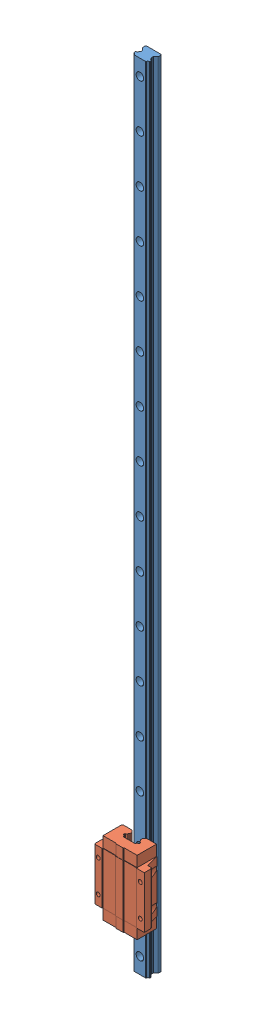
SolidWorks assembly HLW55HC1R1000 E=20.step.sldasm, configuration 默认 (file format 13000). Lengths in mm.
Overall size (63 1000 43.5).
2 component instances, 2 part files, 0 mates.
Components (placement in the parent):
- HLR55R1000 E=20-1: HLR55R1000 E=20.SLDPRT [默认] at origin size (20 1000 17.5)
- HLW55HC-1: HLW55HC.SLDPRT [默认] at (0 107.4 26) size (63 92.2 25.4)
